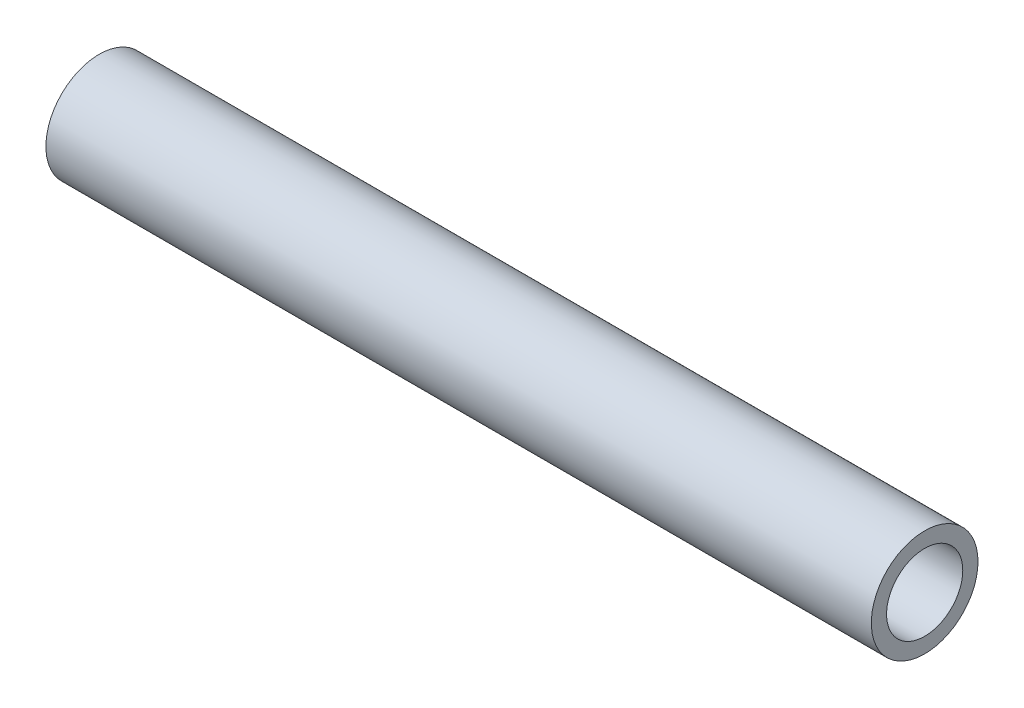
ISO-10303-21;
HEADER;
FILE_DESCRIPTION(('STEP AP214'),'2;1');
FILE_NAME('part.step','',(''),(''),'','','');
FILE_SCHEMA(('AUTOMOTIVE_DESIGN { 1 0 10303 214 1 1 1 1 }'));
ENDSEC;
DATA;
#1=APPLICATION_CONTEXT('core data for automotive mechanical design processes');
#2=APPLICATION_PROTOCOL_DEFINITION('international standard','automotive_design',2000,#1);
#3=PRODUCT_CONTEXT('',#1,'mechanical');
#4=PRODUCT('Part','Part','',(#3));
#5=PRODUCT_RELATED_PRODUCT_CATEGORY('part','',(#4));
#6=PRODUCT_DEFINITION_FORMATION('','',#4);
#7=PRODUCT_DEFINITION_CONTEXT('part definition',#1,'design');
#8=PRODUCT_DEFINITION('design','',#6,#7);
#9=PRODUCT_DEFINITION_SHAPE('','',#8);
#10=(LENGTH_UNIT() NAMED_UNIT(*) SI_UNIT(.MILLI.,.METRE.));
#11=(NAMED_UNIT(*) PLANE_ANGLE_UNIT() SI_UNIT($,.RADIAN.));
#12=(NAMED_UNIT(*) SI_UNIT($,.STERADIAN.) SOLID_ANGLE_UNIT());
#13=UNCERTAINTY_MEASURE_WITH_UNIT(LENGTH_MEASURE(1.E-05),#10,'distance_accuracy_value','');
#14=(GEOMETRIC_REPRESENTATION_CONTEXT(3) GLOBAL_UNCERTAINTY_ASSIGNED_CONTEXT((#13)) GLOBAL_UNIT_ASSIGNED_CONTEXT((#10,
#11,#12)) REPRESENTATION_CONTEXT('',''));
#15=CARTESIAN_POINT('',(0.,0.,0.));
#16=DIRECTION('',(0.,0.,1.));
#17=DIRECTION('',(1.,0.,0.));
#18=AXIS2_PLACEMENT_3D('',#15,#16,#17);
#19=CARTESIAN_POINT('',(165.1,0.,0.));
#20=DIRECTION('',(-1.,0.,0.));
#21=DIRECTION('',(0.,0.,1.));
#22=AXIS2_PLACEMENT_3D('',#19,#20,#21);
#23=CYLINDRICAL_SURFACE('',#22,7.62);
#24=CARTESIAN_POINT('',(165.1,0.,0.));
#25=DIRECTION('',(1.,0.,0.));
#26=DIRECTION('',(0.,0.,-1.));
#27=AXIS2_PLACEMENT_3D('',#24,#25,#26);
#28=CIRCLE('',#27,7.62);
#29=CARTESIAN_POINT('',(165.1,0.,-7.62));
#30=VERTEX_POINT('',#29);
#31=EDGE_CURVE('E43',#30,#30,#28,.T.);
#32=ORIENTED_EDGE('',*,*,#31,.T.);
#33=EDGE_LOOP('',(#32));
#34=FACE_BOUND('',#33,.T.);
#35=CARTESIAN_POINT('',(0.,0.,0.));
#36=DIRECTION('',(1.,0.,0.));
#37=DIRECTION('',(0.,0.,-1.));
#38=AXIS2_PLACEMENT_3D('',#35,#36,#37);
#39=CIRCLE('',#38,7.62);
#40=CARTESIAN_POINT('',(0.,0.,-7.62));
#41=VERTEX_POINT('',#40);
#42=EDGE_CURVE('E49',#41,#41,#39,.T.);
#43=ORIENTED_EDGE('',*,*,#42,.F.);
#44=EDGE_LOOP('',(#43));
#45=FACE_BOUND('',#44,.T.);
#46=ADVANCED_FACE('F36',(#34,#45),#23,.F.);
#47=CARTESIAN_POINT('',(165.1,0.,0.));
#48=DIRECTION('',(-1.,0.,0.));
#49=DIRECTION('',(0.,0.,1.));
#50=AXIS2_PLACEMENT_3D('',#47,#48,#49);
#51=CYLINDRICAL_SURFACE('',#50,10.668);
#52=CARTESIAN_POINT('',(165.1,0.,0.));
#53=DIRECTION('',(1.,0.,0.));
#54=DIRECTION('',(0.,0.,-1.));
#55=AXIS2_PLACEMENT_3D('',#52,#53,#54);
#56=CIRCLE('',#55,10.668);
#57=CARTESIAN_POINT('',(165.1,0.,-10.668));
#58=VERTEX_POINT('',#57);
#59=EDGE_CURVE('E10',#58,#58,#56,.T.);
#60=ORIENTED_EDGE('',*,*,#59,.F.);
#61=EDGE_LOOP('',(#60));
#62=FACE_BOUND('',#61,.T.);
#63=CARTESIAN_POINT('',(0.,0.,0.));
#64=DIRECTION('',(1.,0.,0.));
#65=DIRECTION('',(0.,0.,-1.));
#66=AXIS2_PLACEMENT_3D('',#63,#64,#65);
#67=CIRCLE('',#66,10.668);
#68=CARTESIAN_POINT('',(0.,0.,-10.668));
#69=VERTEX_POINT('',#68);
#70=EDGE_CURVE('E39',#69,#69,#67,.T.);
#71=ORIENTED_EDGE('',*,*,#70,.T.);
#72=EDGE_LOOP('',(#71));
#73=FACE_BOUND('',#72,.T.);
#74=ADVANCED_FACE('F56',(#62,#73),#51,.T.);
#75=CARTESIAN_POINT('',(165.1,0.,0.));
#76=DIRECTION('',(1.,0.,0.));
#77=DIRECTION('',(0.,0.,-1.));
#78=AXIS2_PLACEMENT_3D('',#75,#76,#77);
#79=PLANE('',#78);
#80=ORIENTED_EDGE('',*,*,#31,.F.);
#81=EDGE_LOOP('',(#80));
#82=FACE_BOUND('',#81,.T.);
#83=ORIENTED_EDGE('',*,*,#59,.T.);
#84=EDGE_LOOP('',(#83));
#85=FACE_BOUND('',#84,.T.);
#86=ADVANCED_FACE('F60',(#82,#85),#79,.T.);
#87=CARTESIAN_POINT('',(0.,0.,0.));
#88=DIRECTION('',(1.,0.,0.));
#89=DIRECTION('',(0.,0.,-1.));
#90=AXIS2_PLACEMENT_3D('',#87,#88,#89);
#91=PLANE('',#90);
#92=ORIENTED_EDGE('',*,*,#42,.T.);
#93=EDGE_LOOP('',(#92));
#94=FACE_BOUND('',#93,.T.);
#95=ORIENTED_EDGE('',*,*,#70,.F.);
#96=EDGE_LOOP('',(#95));
#97=FACE_BOUND('',#96,.T.);
#98=ADVANCED_FACE('F58',(#94,#97),#91,.F.);
#99=CLOSED_SHELL('',(#46,#74,#86,#98));
#100=MANIFOLD_SOLID_BREP('B2',#99);
#101=ADVANCED_BREP_SHAPE_REPRESENTATION('',(#18,#100),#14);
#102=SHAPE_DEFINITION_REPRESENTATION(#9,#101);
ENDSEC;
END-ISO-10303-21;
